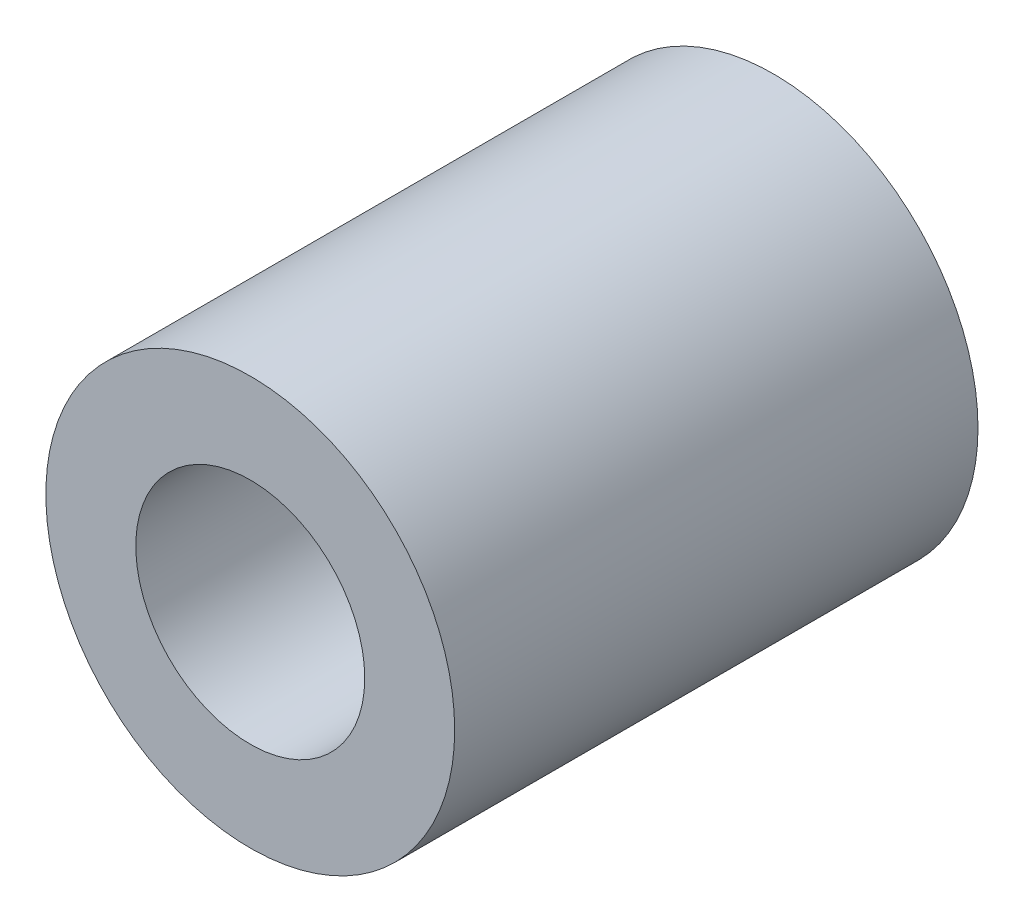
ISO-10303-21;
HEADER;
FILE_DESCRIPTION(('STEP AP214'),'2;1');
FILE_NAME('part.step','',(''),(''),'','','');
FILE_SCHEMA(('AUTOMOTIVE_DESIGN { 1 0 10303 214 1 1 1 1 }'));
ENDSEC;
DATA;
#1=APPLICATION_CONTEXT('core data for automotive mechanical design processes');
#2=APPLICATION_PROTOCOL_DEFINITION('international standard','automotive_design',2000,#1);
#3=PRODUCT_CONTEXT('',#1,'mechanical');
#4=PRODUCT('Part','Part','',(#3));
#5=PRODUCT_RELATED_PRODUCT_CATEGORY('part','',(#4));
#6=PRODUCT_DEFINITION_FORMATION('','',#4);
#7=PRODUCT_DEFINITION_CONTEXT('part definition',#1,'design');
#8=PRODUCT_DEFINITION('design','',#6,#7);
#9=PRODUCT_DEFINITION_SHAPE('','',#8);
#10=(LENGTH_UNIT() NAMED_UNIT(*) SI_UNIT(.MILLI.,.METRE.));
#11=(NAMED_UNIT(*) PLANE_ANGLE_UNIT() SI_UNIT($,.RADIAN.));
#12=(NAMED_UNIT(*) SI_UNIT($,.STERADIAN.) SOLID_ANGLE_UNIT());
#13=UNCERTAINTY_MEASURE_WITH_UNIT(LENGTH_MEASURE(1.E-05),#10,'distance_accuracy_value','');
#14=(GEOMETRIC_REPRESENTATION_CONTEXT(3) GLOBAL_UNCERTAINTY_ASSIGNED_CONTEXT((#13)) GLOBAL_UNIT_ASSIGNED_CONTEXT((#10,
#11,#12)) REPRESENTATION_CONTEXT('',''));
#15=CARTESIAN_POINT('',(0.,0.,0.));
#16=DIRECTION('',(0.,0.,1.));
#17=DIRECTION('',(1.,0.,0.));
#18=AXIS2_PLACEMENT_3D('',#15,#16,#17);
#19=CARTESIAN_POINT('',(7.,0.,7.));
#20=DIRECTION('',(0.,0.,-1.));
#21=DIRECTION('',(-1.,0.,0.));
#22=AXIS2_PLACEMENT_3D('',#19,#20,#21);
#23=PLANE('',#22);
#24=CARTESIAN_POINT('',(0.,0.,7.));
#25=DIRECTION('',(0.,0.,1.));
#26=DIRECTION('',(1.,0.,0.));
#27=AXIS2_PLACEMENT_3D('',#24,#25,#26);
#28=CIRCLE('',#27,4.5);
#29=CARTESIAN_POINT('',(4.5,0.,7.));
#30=VERTEX_POINT('',#29);
#31=EDGE_CURVE('E8',#30,#30,#28,.T.);
#32=ORIENTED_EDGE('',*,*,#31,.F.);
#33=EDGE_LOOP('',(#32));
#34=FACE_BOUND('',#33,.T.);
#35=CARTESIAN_POINT('',(0.,0.,7.));
#36=DIRECTION('',(0.,0.,1.));
#37=DIRECTION('',(1.,0.,0.));
#38=AXIS2_PLACEMENT_3D('',#35,#36,#37);
#39=CIRCLE('',#38,7.);
#40=CARTESIAN_POINT('',(7.,0.,7.));
#41=VERTEX_POINT('',#40);
#42=EDGE_CURVE('E34',#41,#41,#39,.T.);
#43=ORIENTED_EDGE('',*,*,#42,.T.);
#44=EDGE_LOOP('',(#43));
#45=FACE_BOUND('',#44,.T.);
#46=ADVANCED_FACE('F12',(#34,#45),#23,.F.);
#47=CARTESIAN_POINT('',(0.,0.,40.));
#48=DIRECTION('',(0.,0.,1.));
#49=DIRECTION('',(1.,0.,0.));
#50=AXIS2_PLACEMENT_3D('',#47,#48,#49);
#51=CYLINDRICAL_SURFACE('',#50,4.5);
#52=CARTESIAN_POINT('',(0.,0.,0.));
#53=DIRECTION('',(0.,0.,1.));
#54=DIRECTION('',(1.,0.,0.));
#55=AXIS2_PLACEMENT_3D('',#52,#53,#54);
#56=CIRCLE('',#55,4.5);
#57=CARTESIAN_POINT('',(4.5,0.,0.));
#58=VERTEX_POINT('',#57);
#59=EDGE_CURVE('E18',#58,#58,#56,.T.);
#60=ORIENTED_EDGE('',*,*,#59,.F.);
#61=EDGE_LOOP('',(#60));
#62=FACE_BOUND('',#61,.T.);
#63=ORIENTED_EDGE('',*,*,#31,.T.);
#64=EDGE_LOOP('',(#63));
#65=FACE_BOUND('',#64,.T.);
#66=ADVANCED_FACE('F59',(#62,#65),#51,.F.);
#67=CARTESIAN_POINT('',(4.5,0.,0.));
#68=DIRECTION('',(0.,0.,1.));
#69=DIRECTION('',(1.,0.,0.));
#70=AXIS2_PLACEMENT_3D('',#67,#68,#69);
#71=PLANE('',#70);
#72=CARTESIAN_POINT('',(0.,0.,0.));
#73=DIRECTION('',(0.,0.,1.));
#74=DIRECTION('',(1.,0.,0.));
#75=AXIS2_PLACEMENT_3D('',#72,#73,#74);
#76=CIRCLE('',#75,12.5);
#77=CARTESIAN_POINT('',(12.5,0.,0.));
#78=VERTEX_POINT('',#77);
#79=EDGE_CURVE('E22',#78,#78,#76,.T.);
#80=ORIENTED_EDGE('',*,*,#79,.F.);
#81=EDGE_LOOP('',(#80));
#82=FACE_BOUND('',#81,.T.);
#83=ORIENTED_EDGE('',*,*,#59,.T.);
#84=EDGE_LOOP('',(#83));
#85=FACE_BOUND('',#84,.T.);
#86=ADVANCED_FACE('F54',(#82,#85),#71,.F.);
#87=CARTESIAN_POINT('',(0.,0.,40.));
#88=DIRECTION('',(0.,0.,1.));
#89=DIRECTION('',(1.,0.,0.));
#90=AXIS2_PLACEMENT_3D('',#87,#88,#89);
#91=CYLINDRICAL_SURFACE('',#90,12.5);
#92=CARTESIAN_POINT('',(0.,0.,32.));
#93=DIRECTION('',(0.,0.,1.));
#94=DIRECTION('',(1.,0.,0.));
#95=AXIS2_PLACEMENT_3D('',#92,#93,#94);
#96=CIRCLE('',#95,12.5);
#97=CARTESIAN_POINT('',(12.5,0.,32.));
#98=VERTEX_POINT('',#97);
#99=EDGE_CURVE('E26',#98,#98,#96,.T.);
#100=ORIENTED_EDGE('',*,*,#99,.F.);
#101=EDGE_LOOP('',(#100));
#102=FACE_BOUND('',#101,.T.);
#103=ORIENTED_EDGE('',*,*,#79,.T.);
#104=EDGE_LOOP('',(#103));
#105=FACE_BOUND('',#104,.T.);
#106=ADVANCED_FACE('F48',(#102,#105),#91,.T.);
#107=CARTESIAN_POINT('',(12.5,0.,32.));
#108=DIRECTION('',(0.,0.,-1.));
#109=DIRECTION('',(-1.,0.,0.));
#110=AXIS2_PLACEMENT_3D('',#107,#108,#109);
#111=PLANE('',#110);
#112=CARTESIAN_POINT('',(0.,0.,32.));
#113=DIRECTION('',(0.,0.,1.));
#114=DIRECTION('',(1.,0.,0.));
#115=AXIS2_PLACEMENT_3D('',#112,#113,#114);
#116=CIRCLE('',#115,7.);
#117=CARTESIAN_POINT('',(7.,0.,32.));
#118=VERTEX_POINT('',#117);
#119=EDGE_CURVE('E31',#118,#118,#116,.T.);
#120=ORIENTED_EDGE('',*,*,#119,.F.);
#121=EDGE_LOOP('',(#120));
#122=FACE_BOUND('',#121,.T.);
#123=ORIENTED_EDGE('',*,*,#99,.T.);
#124=EDGE_LOOP('',(#123));
#125=FACE_BOUND('',#124,.T.);
#126=ADVANCED_FACE('F42',(#122,#125),#111,.F.);
#127=CARTESIAN_POINT('',(0.,0.,40.));
#128=DIRECTION('',(0.,0.,1.));
#129=DIRECTION('',(1.,0.,0.));
#130=AXIS2_PLACEMENT_3D('',#127,#128,#129);
#131=CYLINDRICAL_SURFACE('',#130,7.);
#132=ORIENTED_EDGE('',*,*,#42,.F.);
#133=EDGE_LOOP('',(#132));
#134=FACE_BOUND('',#133,.T.);
#135=ORIENTED_EDGE('',*,*,#119,.T.);
#136=EDGE_LOOP('',(#135));
#137=FACE_BOUND('',#136,.T.);
#138=ADVANCED_FACE('F39',(#134,#137),#131,.F.);
#139=CLOSED_SHELL('',(#46,#66,#86,#106,#126,#138));
#140=MANIFOLD_SOLID_BREP('B1',#139);
#141=ADVANCED_BREP_SHAPE_REPRESENTATION('',(#18,#140),#14);
#142=SHAPE_DEFINITION_REPRESENTATION(#9,#141);
ENDSEC;
END-ISO-10303-21;
